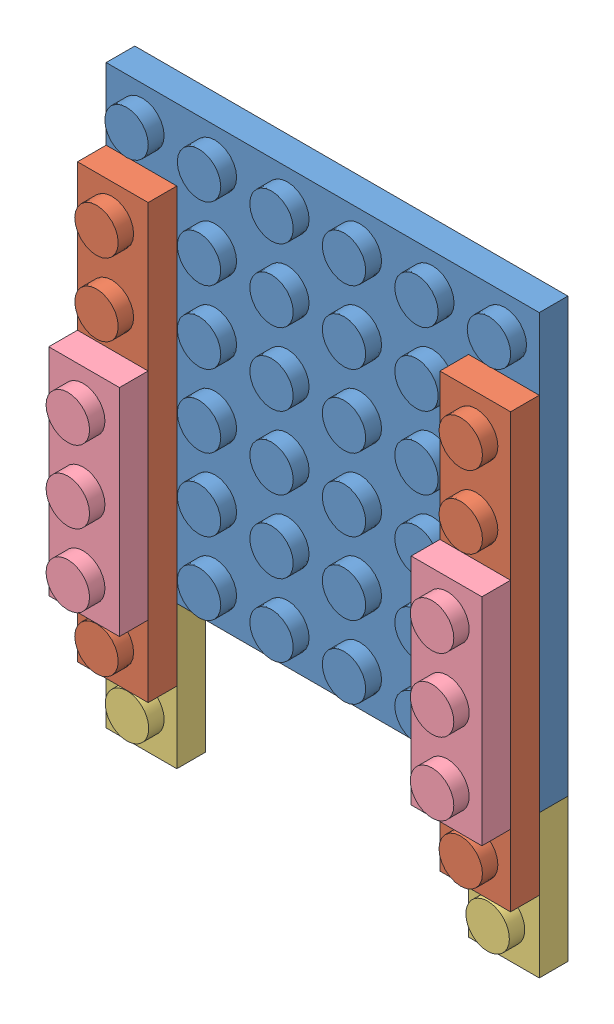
SolidWorks assembly Assem106Seat.SLDASM, configuration Default (file format 4400). Lengths in mm.
Overall size (47.8 63.6 11.2).
7 component instances, 4 part files, 18 mates.
Components (placement in the parent):
- Part0L66Blauw-1: Part0L66Blauw.SLDPRT [기본 설정] at (-21.3443 16.4279 3.6136) size (47.8 47.8 4.91)
- Part0L6Blauw-1: Part0L6Blauw.SLDPRT [Default] at (-22.1219 -31.4039 3.6136) x (0 1 0) z (1 0 0) size (47.8 4.87 7.8)
- Part0L6Blauw-2: Part0L6Blauw.SLDPRT [Default] at (10.0781 16.3961 3.6136) x (0 -1 0) z (-1 0 0) size (47.8 4.87 7.8)
- Part0L2Blauw-1: Part0L2Blauw.SLDPRT [Default] at (17.8781 -23.5039 0.4476) x (-1 0 0) z (0 1 0) size (7.8 4.87 15.8)
- Part0L2Blauw-2: Part0L2Blauw.SLDPRT [Default] at (-29.9219 -39.3039 0.4476) x (1 0 0) z (0 -1 0) size (7.8 4.87 15.8)
- Part0L3Blauw-1: Part0L3Blauw.SLDPRT [Default] at (-22.1219 0.2961 6.7796) x (-1 0 0) z (0 1 0) size (7.8 4.87 23.8)
- Part0L3Blauw-2: Part0L3Blauw.SLDPRT [Default] at (10.0781 -23.5039 6.7796) x (1 0 0) z (0 -1 0) size (7.8 4.87 23.8)
Mates (geometry in assembly coordinates):
- Coincident1: coincident anti-aligned: plane of Part0L66Blauw-1 through (-29.9219 -23.5039 0.4536) normal (0 -1 0); plane of Part0L2Blauw-1 through (17.8781 -23.5039 3.6136) normal (0 1 0)
- Coincident2: coincident aligned: plane of Part0L66Blauw-1 through (17.8781 24.2961 0.4536) normal (1 0 0); plane of Part0L2Blauw-1 through (17.8781 -23.5039 3.6136) normal (1 0 0)
- Coincident3: coincident aligned: plane of Part0L66Blauw-1 through (-29.9219 -23.5039 3.6136) normal (0 0 1); plane of Part0L2Blauw-1 through (17.8781 -39.3039 3.6136) normal (0 0 1)
- Coincident4: coincident aligned: plane of Part0L66Blauw-1 through (17.8781 24.2961 0.4536) normal (1 0 0); plane of Part0L6Blauw-2 through (17.8781 16.3961 6.7796) normal (1 0 0)
- Coincident5: coincident anti-aligned: plane of Part0L66Blauw-1 through (-29.9219 -23.5039 3.6136) normal (0 0 1); plane of Part0L6Blauw-2 through (17.8781 16.3961 3.6136) normal (0 0 -1)
- Width1: width: plane of Part0L2Blauw-1 through (17.8781 -39.3039 3.6136) normal (0 -1 0); plane of Part0L66Blauw-1 through (-29.9219 24.2961 0.4536) normal (0 1 0); plane of Part0L6Blauw-2 through (10.0781 16.3961 6.7796) normal (0 1 0); plane of Part0L6Blauw-2 through (10.0781 -31.4039 6.7796) normal (0 -1 0)
- Coincident12: coincident aligned: plane of Part0L66Blauw-1 through (-29.9219 24.2961 0.4536) normal (-1 0 0); plane of Part0L2Blauw-2 through (-29.9219 -39.3039 3.6136) normal (-1 0 0)
- Coincident13: coincident aligned: plane of Part0L2Blauw-1 through (17.8781 -39.3039 3.6136) normal (0 -1 0); plane of Part0L2Blauw-2 through (-29.9219 -39.3039 3.6136) normal (0 -1 0)
- Coincident14: coincident aligned: plane of Part0L66Blauw-1 through (-29.9219 -23.5039 3.6136) normal (0 0 1); plane of Part0L2Blauw-2 through (-29.9219 -23.5039 3.6136) normal (0 0 1)
- Coincident15: coincident aligned: plane of Part0L6Blauw-1 through (-22.1219 -31.4039 6.7796) normal (0 -1 0); plane of Part0L6Blauw-2 through (10.0781 -31.4039 6.7796) normal (0 -1 0)
- Coincident16: coincident aligned: plane of Part0L66Blauw-1 through (-29.9219 24.2961 0.4536) normal (-1 0 0); plane of Part0L6Blauw-1 through (-29.9219 -31.4039 6.7796) normal (-1 0 0)
- Coincident17: coincident anti-aligned: plane of Part0L66Blauw-1 through (-29.9219 -23.5039 3.6136) normal (0 0 1); plane of Part0L6Blauw-1 through (-29.9219 -31.4039 3.6136) normal (0 0 -1)
- Coincident18: coincident aligned: plane of Part0L6Blauw-1 through (-29.9219 -31.4039 6.7796) normal (-1 0 0); plane of Part0L3Blauw-1 through (-29.9219 0.2961 9.9456) normal (-1 0 0)
- Coincident19: coincident aligned: plane of Part0L66Blauw-1 through (-29.9219 -23.5039 0.4536) normal (0 -1 0); plane of Part0L3Blauw-1 through (-22.1219 -23.5039 9.9456) normal (0 -1 0)
- Coincident20: coincident anti-aligned: plane of Part0L6Blauw-1 through (-29.9219 -31.4039 6.7796) normal (0 0 1); plane of Part0L3Blauw-1 through (-22.1219 -23.5039 6.7796) normal (0 0 -1)
- Coincident21: coincident aligned: plane of Part0L6Blauw-2 through (10.0781 16.3961 6.7796) normal (-1 0 0); plane of Part0L3Blauw-2 through (10.0781 -23.5039 9.9456) normal (-1 0 0)
- Coincident22: coincident aligned: plane of Part0L66Blauw-1 through (-29.9219 -23.5039 0.4536) normal (0 -1 0); plane of Part0L3Blauw-2 through (10.0781 -23.5039 9.9456) normal (0 -1 0)
- Coincident23: coincident anti-aligned: plane of Part0L6Blauw-2 through (17.8781 16.3961 6.7796) normal (0 0 1); plane of Part0L3Blauw-2 through (10.0781 0.2961 6.7796) normal (0 0 -1)
